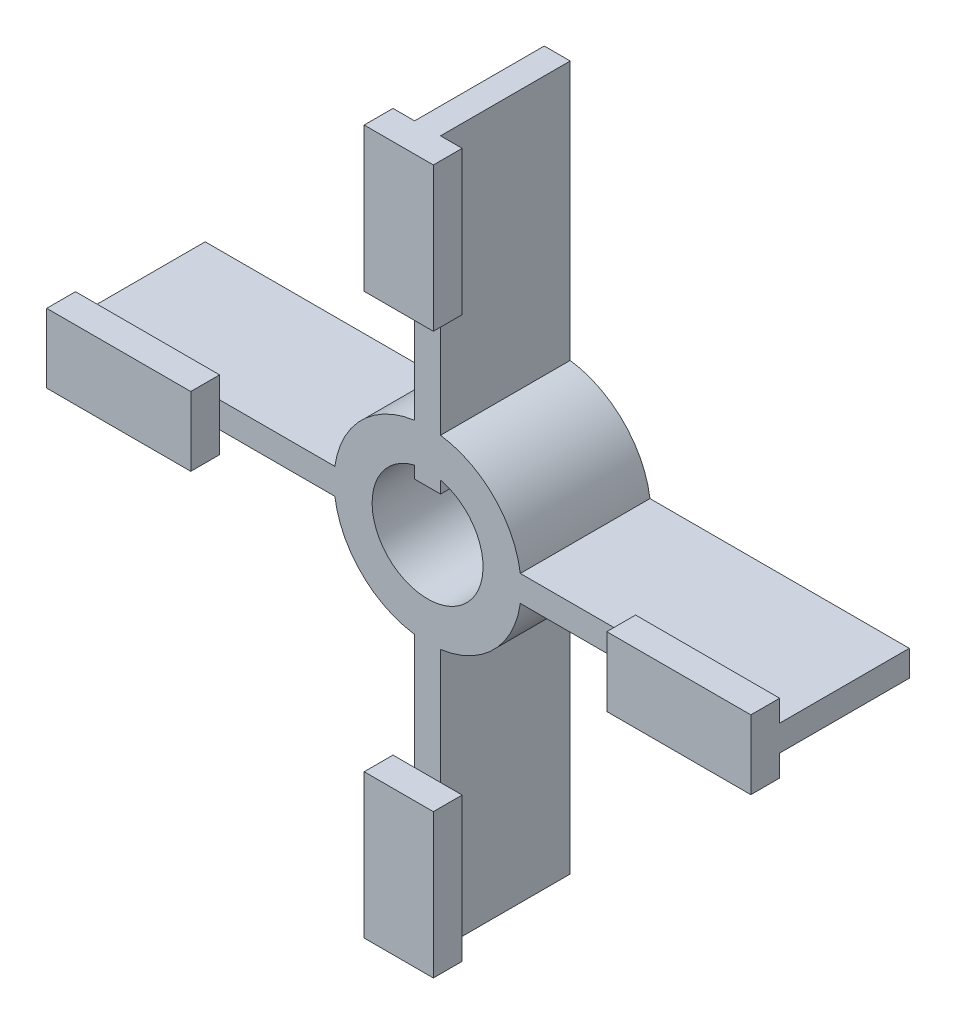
from build123d import *

# Parameters (mm, degrees)
SKETCH1_R           = 4.826
BOSS_EXTRUDE1_DEPTH = 5.715
BOSS_EXTRUDE2_DEPTH = 2.54
CIRPATTERN1_COUNT   = 4
SKETCH4_R           = 4.826
SKETCH4_R_2         = 2.286
BOSS_EXTRUDE3_DEPTH = 11.43
CUT_EXTRUDE1_DEPTH  = 11.43


with BuildPart() as part:
    # Sketch1 → Boss-Extrude1 (new, symmetric)
    with BuildSketch(Plane.XY):
        with BuildLine():
            Line((-1.143, 31.035486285), (-1.143, 8.175486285))
            ThreePointArc((-1.143, 8.175486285), (-5.837166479, 5.837166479), (-8.175486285, 1.143))
            Line((-8.175486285, 1.143), (-31.035486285, 1.143))
            Line((-31.035486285, 1.143), (-31.035486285, -1.143))
            Line((-31.035486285, -1.143), (-8.175486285, -1.143))
            ThreePointArc((-8.175486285, -1.143), (-5.837166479, -5.837166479), (-1.143, -8.175486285))
            Line((-1.143, -8.175486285), (-1.143, -31.035486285))
            Line((-1.143, -31.035486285), (1.143, -31.035486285))
            Line((1.143, -31.035486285), (1.143, -8.175486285))
            ThreePointArc((1.143, -8.175486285), (5.837166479, -5.837166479), (8.175486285, -1.143))
            Line((8.175486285, -1.143), (31.035486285, -1.143))
            Line((31.035486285, -1.143), (31.035486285, 1.143))
            Line((31.035486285, 1.143), (8.175486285, 1.143))
            ThreePointArc((8.175486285, 1.143), (5.837166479, 5.837166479), (1.143, 8.175486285))
            Line((1.143, 8.175486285), (1.143, 31.035486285))
            Line((1.143, 31.035486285), (-1.143, 31.035486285))
        make_face()
        Circle(SKETCH1_R, mode=Mode.SUBTRACT)
    extrude(amount=BOSS_EXTRUDE1_DEPTH, both=True)

    # Sketch2 → Boss-Extrude2 (add)
    with BuildSketch(Plane.XY.offset(5.715)):
        Polygon((1.143, 31.035486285), (3.048, 31.035486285), (3.048, 18.335486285), (1.143, 18.335486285), (-1.143, 18.335486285), (-3.048, 18.335486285), (-3.048, 31.035486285), (-1.143, 31.035486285), align=None)
    boss_extrude2 = extrude(amount=BOSS_EXTRUDE2_DEPTH)

    # CirPattern1: Boss-Extrude2 ×4 about axis
    cirpattern1_axis = Axis((0, 0, 0), (0, 0, 1))
    for i in range(1, CIRPATTERN1_COUNT):
        add(boss_extrude2.rotate(cirpattern1_axis, i * 360 / CIRPATTERN1_COUNT))

    # Sketch4 → Boss-Extrude3 (add)
    with BuildSketch(Plane(origin=(0, 0, -5.715), x_dir=(-1, 0, 0), z_dir=(0, 0, -1))):
        Circle(SKETCH4_R)
        Circle(SKETCH4_R_2, mode=Mode.SUBTRACT)
    extrude(amount=-BOSS_EXTRUDE3_DEPTH)

    # Sketch5 → Cut-Extrude1 (cut)
    with BuildSketch(Plane.XY.offset(5.715)):
        with BuildLine():
            Line((-1.143, 4.754025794), (-1.143, 3.687225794))
            Line((-1.143, 3.687225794), (1.143, 3.687225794))
            Line((1.143, 3.687225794), (1.143, 4.754025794))
            ThreePointArc((1.143, 4.754025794), (0, -4.8895), (-1.143, 4.754025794))
        make_face()
    extrude(amount=-CUT_EXTRUDE1_DEPTH, mode=Mode.SUBTRACT)


solid = part.part
